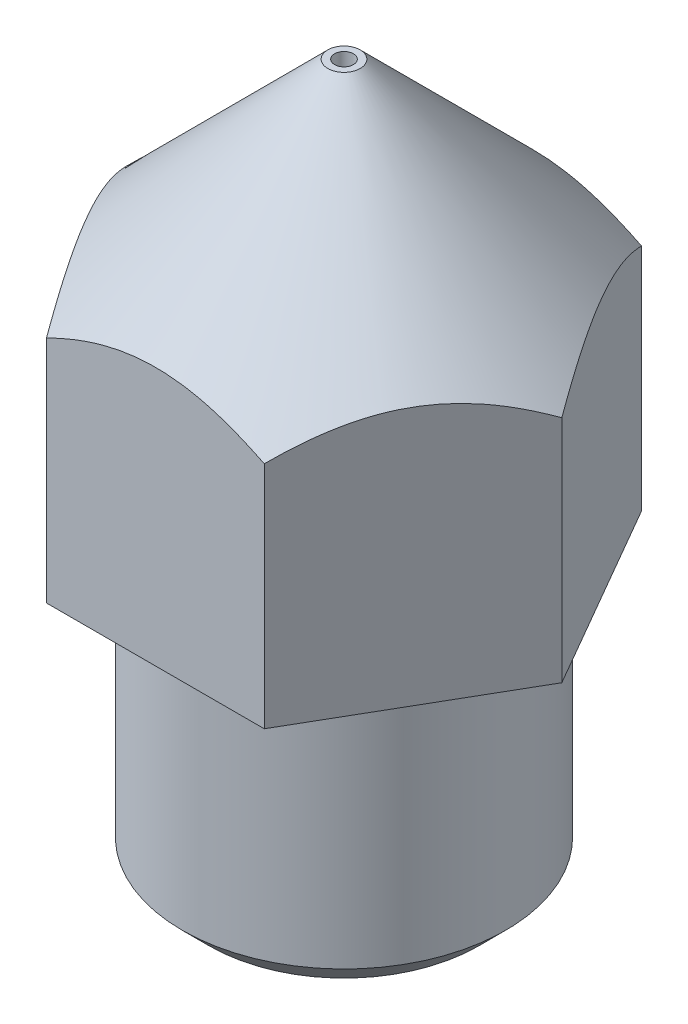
from build123d import *

# Parameters (mm, degrees)
SKETCH1_R           = 3
BOSS_EXTRUDE1_DEPTH = 5
BOSS_EXTRUDE2_DEPTH = 8


with BuildPart() as part:
    # Sketch1 → Boss-Extrude1 (new body)
    with BuildSketch(Plane(origin=(0, 0, 0), x_dir=(1, 0, 0), z_dir=(0, 1, 0))):
        with Locations(Location((0, 0, 0), (0, 0, 270))):
            Circle(SKETCH1_R)
    extrude(amount=BOSS_EXTRUDE1_DEPTH)

    # Sketch2 → Boss-Extrude2 (add)
    with BuildSketch(Plane(origin=(0, 5, 0), x_dir=(1, 0, 0), z_dir=(0, 1, 0))):
        Polygon((2.020725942, 3.5), (-2.020725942, 3.5), (-4.041451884, 0), (-2.020725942, -3.5), (2.020725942, -3.5), (4.041451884, 0), align=None)
    extrude(amount=BOSS_EXTRUDE2_DEPTH)

    # Sketch4 → Cut-Revolve2 (revolve, cut)
    with BuildSketch(Plane.XY, mode=Mode.PRIVATE) as cut_revolve2_sk:
        Polygon((0.3, 13), (4.041451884, 9.258548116), (4.041451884, 13), align=None)
    revolve(cut_revolve2_sk.sketch.rotate(Axis((0, 0, 0), (0, 1, 0)), 90), axis=Axis((0, 0, 0), (0, 1, 0)), mode=Mode.SUBTRACT)

    # Sketch5 → Cut-Revolve3 (revolve, cut)
    with BuildSketch(Plane.XY, mode=Mode.PRIVATE) as cut_revolve3_sk:
        Polygon((2.5, 0), (3, 0.5), (3, 0), align=None)
    revolve(cut_revolve3_sk.sketch.rotate(Axis((0, 13, 0), (0, -1, 0)), 90), axis=Axis((0, 13, 0), (0, -1, 0)), mode=Mode.SUBTRACT)

    # Sketch6 → Cut-Revolve4 (revolve, cut)
    with BuildSketch(Plane.XY, mode=Mode.PRIVATE) as cut_revolve4_sk:
        Polygon((0.175, 13), (0, 13), (0, 0), (1.25, 0), (1.25, 10.638045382), (0.175, 12.5), align=None)
    revolve(cut_revolve4_sk.sketch.rotate(Axis((0, 13, 0), (0, -1, 0)), 90), axis=Axis((0, 13, 0), (0, -1, 0)), mode=Mode.SUBTRACT)


solid = part.part
